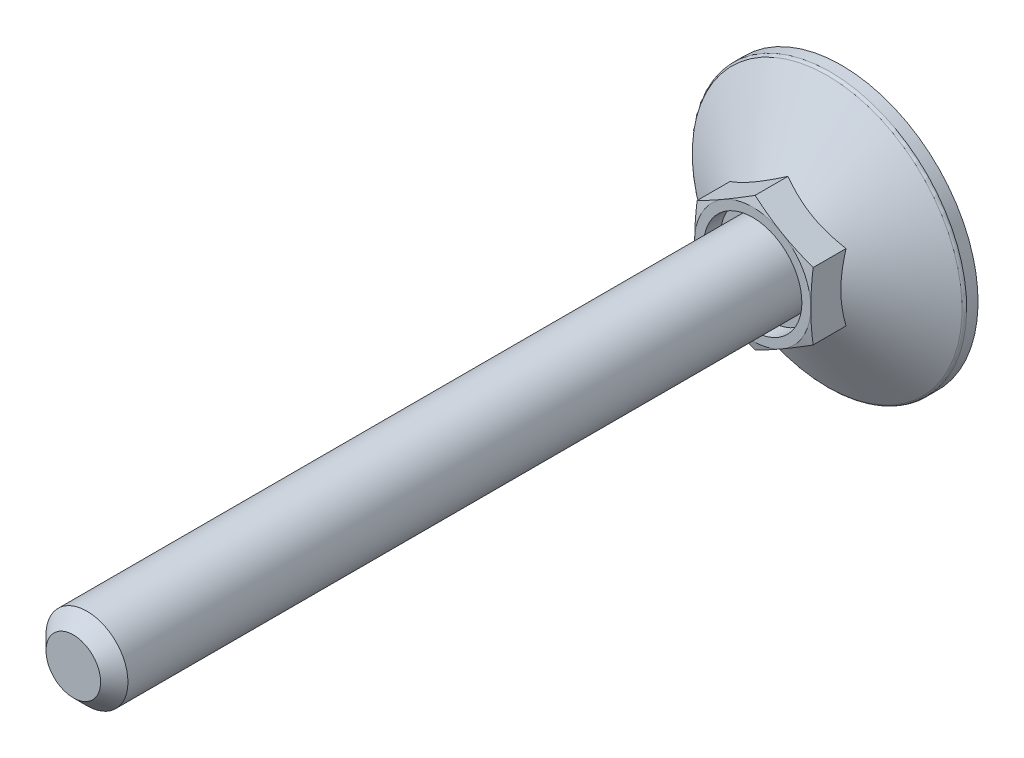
ISO-10303-21;
HEADER;
FILE_DESCRIPTION(('STEP AP214'),'2;1');
FILE_NAME('part.step','',(''),(''),'','','');
FILE_SCHEMA(('AUTOMOTIVE_DESIGN { 1 0 10303 214 1 1 1 1 }'));
ENDSEC;
DATA;
#1=APPLICATION_CONTEXT('core data for automotive mechanical design processes');
#2=APPLICATION_PROTOCOL_DEFINITION('international standard','automotive_design',2000,#1);
#3=PRODUCT_CONTEXT('',#1,'mechanical');
#4=PRODUCT('Part','Part','',(#3));
#5=PRODUCT_RELATED_PRODUCT_CATEGORY('part','',(#4));
#6=PRODUCT_DEFINITION_FORMATION('','',#4);
#7=PRODUCT_DEFINITION_CONTEXT('part definition',#1,'design');
#8=PRODUCT_DEFINITION('design','',#6,#7);
#9=PRODUCT_DEFINITION_SHAPE('','',#8);
#10=(LENGTH_UNIT() NAMED_UNIT(*) SI_UNIT(.MILLI.,.METRE.));
#11=(NAMED_UNIT(*) PLANE_ANGLE_UNIT() SI_UNIT($,.RADIAN.));
#12=(NAMED_UNIT(*) SI_UNIT($,.STERADIAN.) SOLID_ANGLE_UNIT());
#13=UNCERTAINTY_MEASURE_WITH_UNIT(LENGTH_MEASURE(1.E-05),#10,'distance_accuracy_value','');
#14=(GEOMETRIC_REPRESENTATION_CONTEXT(3) GLOBAL_UNCERTAINTY_ASSIGNED_CONTEXT((#13)) GLOBAL_UNIT_ASSIGNED_CONTEXT((#10,
#11,#12)) REPRESENTATION_CONTEXT('',''));
#15=CARTESIAN_POINT('',(0.,0.,0.));
#16=DIRECTION('',(0.,0.,1.));
#17=DIRECTION('',(1.,0.,0.));
#18=AXIS2_PLACEMENT_3D('',#15,#16,#17);
#19=CARTESIAN_POINT('',(0.,0.,10.525));
#20=DIRECTION('',(0.,0.,-1.));
#21=DIRECTION('',(0.,1.,0.));
#22=AXIS2_PLACEMENT_3D('',#19,#20,#21);
#23=PLANE('',#22);
#24=CARTESIAN_POINT('',(0.,0.,10.525));
#25=DIRECTION('',(0.,0.,-1.));
#26=DIRECTION('',(0.,1.,0.));
#27=AXIS2_PLACEMENT_3D('',#24,#25,#26);
#28=CIRCLE('',#27,7.2);
#29=CARTESIAN_POINT('',(0.,7.2,10.525));
#30=VERTEX_POINT('',#29);
#31=EDGE_CURVE('E108',#30,#30,#28,.T.);
#32=ORIENTED_EDGE('',*,*,#31,.F.);
#33=EDGE_LOOP('',(#32));
#34=FACE_BOUND('',#33,.T.);
#35=CARTESIAN_POINT('',(0.,0.,10.525));
#36=DIRECTION('',(0.,0.,-1.));
#37=DIRECTION('',(0.,1.,0.));
#38=AXIS2_PLACEMENT_3D('',#35,#36,#37);
#39=CIRCLE('',#38,6.);
#40=CARTESIAN_POINT('',(0.,6.,10.525));
#41=VERTEX_POINT('',#40);
#42=EDGE_CURVE('E260',#41,#41,#39,.F.);
#43=ORIENTED_EDGE('',*,*,#42,.F.);
#44=EDGE_LOOP('',(#43));
#45=FACE_BOUND('',#44,.T.);
#46=ADVANCED_FACE('F14',(#34,#45),#23,.F.);
#47=CARTESIAN_POINT('',(0.,9.81495457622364,99.));
#48=DIRECTION('',(0.5,-0.866025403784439,0.));
#49=DIRECTION('',(0.866025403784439,0.5,0.));
#50=AXIS2_PLACEMENT_3D('',#47,#48,#49);
#51=PLANE('',#50);
#52=CARTESIAN_POINT('',(-8.5002,4.90736181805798,7.83027204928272));
#53=CARTESIAN_POINT('',(-8.31336077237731,5.01523349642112,7.89254195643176));
#54=CARTESIAN_POINT('',(-8.1258249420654,5.1235073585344,7.95198579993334));
#55=CARTESIAN_POINT('',(-7.74923024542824,5.34093440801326,8.06444298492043));
#56=CARTESIAN_POINT('',(-7.56017075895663,5.45008795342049,8.1174535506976));
#57=CARTESIAN_POINT('',(-6.9899652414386,5.77929626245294,8.26579470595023));
#58=CARTESIAN_POINT('',(-6.60656835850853,6.00065055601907,8.3501691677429));
#59=CARTESIAN_POINT('',(-6.03282233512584,6.33190297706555,8.44910807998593));
#60=CARTESIAN_POINT('',(-5.84418723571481,6.44081150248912,8.47729289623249));
#61=CARTESIAN_POINT('',(-5.46606397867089,6.65912106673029,8.52455401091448));
#62=CARTESIAN_POINT('',(-5.27657589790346,6.76852206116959,8.54363111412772));
#63=CARTESIAN_POINT('',(-4.8972734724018,6.98751241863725,8.57219332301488));
#64=CARTESIAN_POINT('',(-4.7074597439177,7.09710142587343,8.58168931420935));
#65=CARTESIAN_POINT('',(-4.32765694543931,7.3163806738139,8.59088571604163));
#66=CARTESIAN_POINT('',(-4.13766788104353,7.42607091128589,8.59058642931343));
#67=CARTESIAN_POINT('',(-3.78247698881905,7.63114046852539,8.58087362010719));
#68=CARTESIAN_POINT('',(-3.6172500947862,7.72653426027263,8.57264492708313));
#69=CARTESIAN_POINT('',(-3.28718328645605,7.9170984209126,8.54893885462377));
#70=CARTESIAN_POINT('',(-3.12234339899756,8.01226877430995,8.53346098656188));
#71=CARTESIAN_POINT('',(-2.62846189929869,8.29741139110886,8.47651947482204));
#72=CARTESIAN_POINT('',(-2.30029449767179,8.48687892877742,8.42455503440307));
#73=CARTESIAN_POINT('',(-1.64047857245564,8.86782383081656,8.29464315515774));
#74=CARTESIAN_POINT('',(-1.30891425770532,9.05925257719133,8.21614502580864));
#75=CARTESIAN_POINT('',(-0.650730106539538,9.43925537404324,8.03798675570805));
#76=CARTESIAN_POINT('',(-0.324101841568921,9.62783429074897,7.93836845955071));
#77=CARTESIAN_POINT('',(0.000199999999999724,9.81507004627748,7.83027204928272));
#78=B_SPLINE_CURVE_WITH_KNOTS('',3,(#52,#53,#54,#55,#56,#57,#58,#59,#60,#61,#62,#63,#64,#65,#66,
#67,#68,#69,#70,#71,#72,#73,#74,#75,#76,#77),.UNSPECIFIED.,.F.,.F.,(4,2,2,2,2,2,2,2,2,2,2,2,4),
(0.,0.673596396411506,1.34748239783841,2.69805431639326,3.356799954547,4.01548737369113,
4.67342558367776,5.33134346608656,5.90409556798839,6.47688628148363,7.62328361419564,
8.79510569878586,9.9646274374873),.UNSPECIFIED.);
#79=CARTESIAN_POINT('',(-8.5,4.90747728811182,7.83033871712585));
#80=VERTEX_POINT('',#79);
#81=CARTESIAN_POINT('',(0.,9.81495457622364,7.83033871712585));
#82=VERTEX_POINT('',#81);
#83=EDGE_CURVE('E97',#80,#82,#78,.T.);
#84=ORIENTED_EDGE('',*,*,#83,.F.);
#85=DIRECTION('',(0.,0.,-1.));
#86=VECTOR('',#85,1.);
#87=CARTESIAN_POINT('',(-8.5,4.90747728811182,99.));
#88=LINE('',#87,#86);
#89=CARTESIAN_POINT('',(-8.5,4.90747728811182,12.6476589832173));
#90=VERTEX_POINT('',#89);
#91=EDGE_CURVE('E86',#90,#80,#88,.T.);
#92=ORIENTED_EDGE('',*,*,#91,.F.);
#93=CARTESIAN_POINT('',(0.000200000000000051,9.81507004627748,12.6476280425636));
#94=CARTESIAN_POINT('',(-0.352800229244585,9.61126526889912,12.7022599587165));
#95=CARTESIAN_POINT('',(-0.706440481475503,9.40709097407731,12.7518566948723));
#96=CARTESIAN_POINT('',(-1.41496987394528,8.99802133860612,12.8389934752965));
#97=CARTESIAN_POINT('',(-1.76985946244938,8.79312573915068,12.8765286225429));
#98=CARTESIAN_POINT('',(-2.47873586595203,8.38385575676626,12.9373509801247));
#99=CARTESIAN_POINT('',(-2.83271788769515,8.17948414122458,12.9607107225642));
#100=CARTESIAN_POINT('',(-3.5411333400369,7.77048028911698,12.9920337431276));
#101=CARTESIAN_POINT('',(-3.89556667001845,7.56584811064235,13.));
#102=CARTESIAN_POINT('',(-4.60443332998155,7.15658375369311,13.));
#103=CARTESIAN_POINT('',(-4.9588666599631,6.95195157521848,12.9920337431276));
#104=CARTESIAN_POINT('',(-5.66728211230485,6.54294772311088,12.9607107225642));
#105=CARTESIAN_POINT('',(-6.02126413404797,6.33857610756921,12.9373509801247));
#106=CARTESIAN_POINT('',(-6.73014053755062,5.92930612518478,12.8765286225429));
#107=CARTESIAN_POINT('',(-7.08503012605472,5.72441052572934,12.8389934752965));
#108=CARTESIAN_POINT('',(-7.7935595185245,5.31534089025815,12.7518566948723));
#109=CARTESIAN_POINT('',(-8.14719977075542,5.11116659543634,12.7022599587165));
#110=CARTESIAN_POINT('',(-8.5002,4.90736181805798,12.6476280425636));
#111=B_SPLINE_CURVE_WITH_KNOTS('',3,(#93,#94,#95,#96,#97,#98,#99,#100,#101,#102,#103,#104,#105,
#106,#107,#108,#109,#110),.UNSPECIFIED.,.F.,.F.,(4,2,2,2,2,2,2,2,4),(0.,1.23382789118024,
2.46815608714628,3.69611406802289,4.92383440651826,6.15155474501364,7.37951272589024,
8.61384092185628,9.84766881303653),.UNSPECIFIED.);
#112=CARTESIAN_POINT('',(-4.25,7.36121593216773,13.));
#113=VERTEX_POINT('',#112);
#114=EDGE_CURVE('E187',#113,#90,#111,.T.);
#115=ORIENTED_EDGE('',*,*,#114,.F.);
#116=CARTESIAN_POINT('',(0.,9.81495457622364,12.6476589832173));
#117=VERTEX_POINT('',#116);
#118=EDGE_CURVE('E319',#117,#113,#111,.T.);
#119=ORIENTED_EDGE('',*,*,#118,.F.);
#120=DIRECTION('',(0.,0.,-1.));
#121=VECTOR('',#120,1.);
#122=CARTESIAN_POINT('',(0.,9.81495457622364,99.));
#123=LINE('',#122,#121);
#124=EDGE_CURVE('E101',#117,#82,#123,.T.);
#125=ORIENTED_EDGE('',*,*,#124,.T.);
#126=EDGE_LOOP('',(#84,#92,#115,#119,#125));
#127=FACE_BOUND('',#126,.T.);
#128=ADVANCED_FACE('F100',(#127),#51,.F.);
#129=CARTESIAN_POINT('',(8.5,4.90747728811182,99.));
#130=DIRECTION('',(-0.5,-0.866025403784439,0.));
#131=DIRECTION('',(0.866025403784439,-0.5,0.));
#132=AXIS2_PLACEMENT_3D('',#129,#130,#131);
#133=PLANE('',#132);
#134=CARTESIAN_POINT('',(-0.0002,9.81507004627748,7.83027204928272));
#135=CARTESIAN_POINT('',(0.186639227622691,9.70719836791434,7.89254195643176));
#136=CARTESIAN_POINT('',(0.374175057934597,9.59892450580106,7.95198579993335));
#137=CARTESIAN_POINT('',(0.750769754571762,9.3814974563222,8.06444298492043));
#138=CARTESIAN_POINT('',(0.939829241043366,9.27234391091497,8.1174535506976));
#139=CARTESIAN_POINT('',(1.5100347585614,8.94313560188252,8.26579470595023));
#140=CARTESIAN_POINT('',(1.89343164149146,8.72178130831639,8.3501691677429));
#141=CARTESIAN_POINT('',(2.46717766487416,8.39052888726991,8.44910807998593));
#142=CARTESIAN_POINT('',(2.65581276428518,8.28162036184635,8.47729289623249));
#143=CARTESIAN_POINT('',(3.03393602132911,8.06331079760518,8.52455401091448));
#144=CARTESIAN_POINT('',(3.22342410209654,7.95390980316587,8.54363111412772));
#145=CARTESIAN_POINT('',(3.6027265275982,7.73491944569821,8.57219332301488));
#146=CARTESIAN_POINT('',(3.79254025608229,7.62533043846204,8.58168931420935));
#147=CARTESIAN_POINT('',(4.17234305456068,7.40605119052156,8.59088571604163));
#148=CARTESIAN_POINT('',(4.36233211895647,7.29636095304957,8.59058642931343));
#149=CARTESIAN_POINT('',(4.71752301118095,7.09129139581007,8.58087362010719));
#150=CARTESIAN_POINT('',(4.8827499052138,6.99589760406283,8.57264492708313));
#151=CARTESIAN_POINT('',(5.21281671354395,6.80533344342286,8.54893885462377));
#152=CARTESIAN_POINT('',(5.37765660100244,6.71016309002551,8.53346098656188));
#153=CARTESIAN_POINT('',(5.87153810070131,6.42502047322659,8.47651947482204));
#154=CARTESIAN_POINT('',(6.19970550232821,6.23555293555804,8.42455503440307));
#155=CARTESIAN_POINT('',(6.85952142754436,5.8546080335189,8.29464315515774));
#156=CARTESIAN_POINT('',(7.19108574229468,5.66317928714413,8.21614502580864));
#157=CARTESIAN_POINT('',(7.84926989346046,5.28317649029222,8.03798675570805));
#158=CARTESIAN_POINT('',(8.17589815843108,5.09459757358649,7.93836845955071));
#159=CARTESIAN_POINT('',(8.5002,4.90736181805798,7.83027204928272));
#160=B_SPLINE_CURVE_WITH_KNOTS('',3,(#134,#135,#136,#137,#138,#139,#140,#141,#142,#143,#144,
#145,#146,#147,#148,#149,#150,#151,#152,#153,#154,#155,#156,#157,#158,#159),.UNSPECIFIED.,.F.,
.F.,(4,2,2,2,2,2,2,2,2,2,2,2,4),(0.,0.673596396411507,1.34748239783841,2.69805431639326,
3.35679995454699,4.01548737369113,4.67342558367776,5.33134346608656,5.90409556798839,
6.47688628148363,7.62328361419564,8.79510569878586,9.9646274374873),.UNSPECIFIED.);
#161=CARTESIAN_POINT('',(8.5,4.90747728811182,7.83033871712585));
#162=VERTEX_POINT('',#161);
#163=EDGE_CURVE('E29',#82,#162,#160,.T.);
#164=ORIENTED_EDGE('',*,*,#163,.F.);
#165=ORIENTED_EDGE('',*,*,#124,.F.);
#166=CARTESIAN_POINT('',(8.5002,4.90736181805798,12.6476280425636));
#167=CARTESIAN_POINT('',(8.14719977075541,5.11116659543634,12.7022599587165));
#168=CARTESIAN_POINT('',(7.7935595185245,5.31534089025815,12.7518566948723));
#169=CARTESIAN_POINT('',(7.08503012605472,5.72441052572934,12.8389934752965));
#170=CARTESIAN_POINT('',(6.73014053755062,5.92930612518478,12.8765286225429));
#171=CARTESIAN_POINT('',(6.02126413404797,6.33857610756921,12.9373509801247));
#172=CARTESIAN_POINT('',(5.66728211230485,6.54294772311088,12.9607107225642));
#173=CARTESIAN_POINT('',(4.9588666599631,6.95195157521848,12.9920337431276));
#174=CARTESIAN_POINT('',(4.60443332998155,7.15658375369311,13.));
#175=CARTESIAN_POINT('',(3.89556667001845,7.56584811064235,13.));
#176=CARTESIAN_POINT('',(3.5411333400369,7.77048028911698,12.9920337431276));
#177=CARTESIAN_POINT('',(2.83271788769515,8.17948414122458,12.9607107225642));
#178=CARTESIAN_POINT('',(2.47873586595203,8.38385575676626,12.9373509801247));
#179=CARTESIAN_POINT('',(1.76985946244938,8.79312573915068,12.8765286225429));
#180=CARTESIAN_POINT('',(1.41496987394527,8.99802133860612,12.8389934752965));
#181=CARTESIAN_POINT('',(0.7064404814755,9.40709097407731,12.7518566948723));
#182=CARTESIAN_POINT('',(0.352800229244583,9.61126526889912,12.7022599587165));
#183=CARTESIAN_POINT('',(-0.000200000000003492,9.81507004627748,12.6476280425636));
#184=B_SPLINE_CURVE_WITH_KNOTS('',3,(#166,#167,#168,#169,#170,#171,#172,#173,#174,#175,#176,
#177,#178,#179,#180,#181,#182,#183),.UNSPECIFIED.,.F.,.F.,(4,2,2,2,2,2,2,2,4),(0.,
1.23382789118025,2.46815608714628,3.69611406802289,4.92383440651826,6.15155474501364,
7.37951272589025,8.61384092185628,9.84766881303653),.UNSPECIFIED.);
#185=CARTESIAN_POINT('',(4.25,7.36121593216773,13.));
#186=VERTEX_POINT('',#185);
#187=EDGE_CURVE('E178',#186,#117,#184,.T.);
#188=ORIENTED_EDGE('',*,*,#187,.F.);
#189=CARTESIAN_POINT('',(8.5,4.90747728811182,12.6476589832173));
#190=VERTEX_POINT('',#189);
#191=EDGE_CURVE('E185',#190,#186,#184,.T.);
#192=ORIENTED_EDGE('',*,*,#191,.F.);
#193=DIRECTION('',(0.,0.,-1.));
#194=VECTOR('',#193,1.);
#195=CARTESIAN_POINT('',(8.5,4.90747728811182,99.));
#196=LINE('',#195,#194);
#197=EDGE_CURVE('E217',#190,#162,#196,.T.);
#198=ORIENTED_EDGE('',*,*,#197,.T.);
#199=EDGE_LOOP('',(#164,#165,#188,#192,#198));
#200=FACE_BOUND('',#199,.T.);
#201=ADVANCED_FACE('F193',(#200),#133,.F.);
#202=CARTESIAN_POINT('',(8.5,-4.90747728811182,99.));
#203=DIRECTION('',(-1.,0.,0.));
#204=DIRECTION('',(0.,-1.,0.));
#205=AXIS2_PLACEMENT_3D('',#202,#203,#204);
#206=PLANE('',#205);
#207=CARTESIAN_POINT('',(8.5,12.8220542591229,4.61528116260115));
#208=CARTESIAN_POINT('',(8.5,12.4534155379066,4.79262377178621));
#209=CARTESIAN_POINT('',(8.5,12.0838902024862,4.96815716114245));
#210=CARTESIAN_POINT('',(8.5,11.3425927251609,5.31457894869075));
#211=CARTESIAN_POINT('',(8.5,10.9708202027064,5.48546653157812));
#212=CARTESIAN_POINT('',(8.5,10.2224625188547,5.82250763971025));
#213=CARTESIAN_POINT('',(8.5,9.84586188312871,5.98862693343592));
#214=CARTESIAN_POINT('',(8.5,9.08953299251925,6.31355867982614));
#215=CARTESIAN_POINT('',(8.5,8.70980489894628,6.47237150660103));
#216=CARTESIAN_POINT('',(8.5,7.93635853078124,6.78489169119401));
#217=CARTESIAN_POINT('',(8.5,7.5425381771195,6.93834789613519));
#218=CARTESIAN_POINT('',(8.5,6.75016193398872,7.23275009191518));
#219=CARTESIAN_POINT('',(8.5,6.35160550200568,7.37369463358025));
#220=CARTESIAN_POINT('',(8.5,5.54998630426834,7.63911020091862));
#221=CARTESIAN_POINT('',(8.5,5.14693580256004,7.76361784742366));
#222=CARTESIAN_POINT('',(8.5,4.33508769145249,7.99193558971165));
#223=CARTESIAN_POINT('',(8.5,3.92629204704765,8.09575258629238));
#224=CARTESIAN_POINT('',(8.5,3.10458766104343,8.27700176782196));
#225=CARTESIAN_POINT('',(8.5,2.69170444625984,8.35454642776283));
#226=CARTESIAN_POINT('',(8.5,2.06892742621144,8.44757828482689));
#227=CARTESIAN_POINT('',(8.5,1.86074253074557,8.47470931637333));
#228=CARTESIAN_POINT('',(8.5,1.44346514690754,8.52067173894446));
#229=CARTESIAN_POINT('',(8.5,1.23437274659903,8.5395039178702));
#230=CARTESIAN_POINT('',(8.5,0.818123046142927,8.5682751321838));
#231=CARTESIAN_POINT('',(8.5,0.6109730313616,8.57831925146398));
#232=CARTESIAN_POINT('',(8.5,0.196434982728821,8.58967320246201));
#233=CARTESIAN_POINT('',(8.5,-0.0109530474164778,8.59098316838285));
#234=CARTESIAN_POINT('',(8.5,-0.425608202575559,8.58483724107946));
#235=CARTESIAN_POINT('',(8.5,-0.632875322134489,8.57738097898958));
#236=CARTESIAN_POINT('',(8.5,-1.04692490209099,8.55387613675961));
#237=CARTESIAN_POINT('',(8.5,-1.25370733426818,8.5378270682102));
#238=CARTESIAN_POINT('',(8.5,-1.76172684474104,8.48816674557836));
#239=CARTESIAN_POINT('',(8.5,-2.06251418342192,8.44986872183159));
#240=CARTESIAN_POINT('',(8.5,-2.66160170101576,8.35726697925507));
#241=CARTESIAN_POINT('',(8.5,-2.95990148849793,8.30296078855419));
#242=CARTESIAN_POINT('',(8.5,-3.85084347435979,8.11893322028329));
#243=CARTESIAN_POINT('',(8.5,-4.4391769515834,7.96814146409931));
#244=CARTESIAN_POINT('',(8.5,-5.31919968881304,7.70971639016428));
#245=CARTESIAN_POINT('',(8.5,-5.61551051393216,7.61694416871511));
#246=CARTESIAN_POINT('',(8.5,-6.20524874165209,7.4225646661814));
#247=CARTESIAN_POINT('',(8.5,-6.4986761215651,7.3209573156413));
#248=CARTESIAN_POINT('',(8.5,-7.08276471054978,7.11046965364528));
#249=CARTESIAN_POINT('',(8.5,-7.37342689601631,7.0015920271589));
#250=CARTESIAN_POINT('',(8.5,-7.95239195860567,6.77777126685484));
#251=CARTESIAN_POINT('',(8.5,-8.2406948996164,6.66282829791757));
#252=CARTESIAN_POINT('',(8.5,-8.80562449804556,6.43181846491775));
#253=CARTESIAN_POINT('',(8.5,-9.08231928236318,6.31591764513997));
#254=CARTESIAN_POINT('',(8.5,-9.63401072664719,6.0801365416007));
#255=CARTESIAN_POINT('',(8.5,-9.90900735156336,5.96025617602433));
#256=CARTESIAN_POINT('',(8.5,-10.7318217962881,5.59557173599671));
#257=CARTESIAN_POINT('',(8.5,-11.2774137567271,5.34574521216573));
#258=CARTESIAN_POINT('',(8.5,-12.3642460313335,4.83628492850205));
#259=CARTESIAN_POINT('',(8.5,-12.905484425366,4.57664710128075));
#260=CARTESIAN_POINT('',(8.5,-13.9843891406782,4.05013469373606));
#261=CARTESIAN_POINT('',(8.5,-14.5220556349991,3.78326046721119));
#262=CARTESIAN_POINT('',(8.5,-15.5954930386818,3.24355438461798));
#263=CARTESIAN_POINT('',(8.5,-16.1312593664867,2.97071343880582));
#264=CARTESIAN_POINT('',(8.5,-17.2005865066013,2.4207361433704));
#265=CARTESIAN_POINT('',(8.5,-17.7341472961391,2.14359974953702));
#266=CARTESIAN_POINT('',(8.5,-18.7993643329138,1.58600707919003));
#267=CARTESIAN_POINT('',(8.5,-19.3310210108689,1.30555162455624));
#268=CARTESIAN_POINT('',(8.5,-20.3928917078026,0.741921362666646));
#269=CARTESIAN_POINT('',(8.5,-20.9231057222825,0.458746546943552));
#270=CARTESIAN_POINT('',(8.5,-22.3874236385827,-0.32722037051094));
#271=CARTESIAN_POINT('',(8.5,-23.3202800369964,-0.83233607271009));
#272=CARTESIAN_POINT('',(8.5,-25.1833983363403,-1.84747335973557));
#273=CARTESIAN_POINT('',(8.5,-26.1136600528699,-2.35749528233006));
#274=CARTESIAN_POINT('',(8.5,-27.9692131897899,-3.37950461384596));
#275=CARTESIAN_POINT('',(8.5,-28.8945109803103,-3.89148046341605));
#276=CARTESIAN_POINT('',(8.5,-30.2812847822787,-4.66146611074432));
#277=CARTESIAN_POINT('',(8.5,-30.7433285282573,-4.91845451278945));
#278=CARTESIAN_POINT('',(8.5,-31.6670795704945,-5.43303439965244));
#279=CARTESIAN_POINT('',(8.5,-32.1287868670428,-5.69062588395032));
#280=CARTESIAN_POINT('',(8.5,-32.5903473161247,-5.94848028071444));
#281=B_SPLINE_CURVE_WITH_KNOTS('',3,(#207,#208,#209,#210,#211,#212,#213,#214,#215,#216,#217,
#218,#219,#220,#221,#222,#223,#224,#225,#226,#227,#228,#229,#230,#231,#232,#233,#234,#235,#236,
#237,#238,#239,#240,#241,#242,#243,#244,#245,#246,#247,#248,#249,#250,#251,#252,#253,#254,#255,
#256,#257,#258,#259,#260,#261,#262,#263,#264,#265,#266,#267,#268,#269,#270,#271,#272,#273,#274,
#275,#276,#277,#278,#279,#280),.UNSPECIFIED.,.F.,.F.,(4,2,2,2,2,2,2,2,2,2,2,2,2,2,2,2,2,2,2,2,2,
2,2,2,2,2,2,2,2,2,2,2,2,2,2,2,4),(0.,1.22725127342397,2.45471654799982,3.68948778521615,
4.92419572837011,6.19201746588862,7.45998585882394,8.72507978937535,9.98975107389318,
11.2489376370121,11.878634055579,12.5082706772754,13.1302712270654,13.7522622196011,
14.3742793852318,14.9963319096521,15.9054589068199,16.814726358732,18.6343169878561,
19.5657329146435,20.4971561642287,21.4282373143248,22.3592931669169,23.259222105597,
24.1591695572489,25.9592281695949,27.7600413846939,29.5607667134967,31.3644583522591,
33.1681685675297,34.9714411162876,36.7747192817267,39.9571898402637,43.1398810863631,
46.3123590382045,47.8984694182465,49.4845784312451),.UNSPECIFIED.);
#282=CARTESIAN_POINT('',(8.5,-4.90747728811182,7.83033871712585));
#283=VERTEX_POINT('',#282);
#284=EDGE_CURVE('E37',#162,#283,#281,.T.);
#285=ORIENTED_EDGE('',*,*,#284,.F.);
#286=ORIENTED_EDGE('',*,*,#197,.F.);
#287=CARTESIAN_POINT('',(8.5,12.9820891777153,11.1197370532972));
#288=CARTESIAN_POINT('',(8.5,12.5964686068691,11.2061594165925));
#289=CARTESIAN_POINT('',(8.5,12.2106068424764,11.2915248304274));
#290=CARTESIAN_POINT('',(8.5,11.4382824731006,11.4595712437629));
#291=CARTESIAN_POINT('',(8.5,11.0518198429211,11.5422521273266));
#292=CARTESIAN_POINT('',(8.5,10.2778290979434,11.7044309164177));
#293=CARTESIAN_POINT('',(8.5,9.89030030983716,11.7839256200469));
#294=CARTESIAN_POINT('',(8.5,9.11443612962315,11.9388739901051));
#295=CARTESIAN_POINT('',(8.5,8.72610074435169,12.0143276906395));
#296=CARTESIAN_POINT('',(8.5,7.95158013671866,12.159650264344));
#297=CARTESIAN_POINT('',(8.5,7.56540239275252,12.2295587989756));
#298=CARTESIAN_POINT('',(8.5,6.79199352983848,12.3632725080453));
#299=CARTESIAN_POINT('',(8.5,6.40476243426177,12.4270778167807));
#300=CARTESIAN_POINT('',(8.5,5.62917169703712,12.54714843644));
#301=CARTESIAN_POINT('',(8.5,5.24081220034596,12.6034146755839));
#302=CARTESIAN_POINT('',(8.5,4.46285737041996,12.70674908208));
#303=CARTESIAN_POINT('',(8.5,4.07326203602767,12.7538172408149));
#304=CARTESIAN_POINT('',(8.5,3.28844017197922,12.8374226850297));
#305=CARTESIAN_POINT('',(8.5,2.89320002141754,12.8738340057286));
#306=CARTESIAN_POINT('',(8.5,2.10172608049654,12.9336139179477));
#307=CARTESIAN_POINT('',(8.5,1.70549231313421,12.9569828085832));
#308=CARTESIAN_POINT('',(8.5,0.912605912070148,12.9893148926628));
#309=CARTESIAN_POINT('',(8.5,0.515953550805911,12.9982846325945));
#310=CARTESIAN_POINT('',(8.5,-0.27740821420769,13.0012669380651));
#311=CARTESIAN_POINT('',(8.5,-0.674117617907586,12.9952795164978));
#312=CARTESIAN_POINT('',(8.5,-1.46847963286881,12.9686842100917));
#313=CARTESIAN_POINT('',(8.5,-1.86613043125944,12.9480232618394));
#314=CARTESIAN_POINT('',(8.5,-2.66049684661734,12.8932602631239));
#315=CARTESIAN_POINT('',(8.5,-3.05721244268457,12.8591579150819));
#316=CARTESIAN_POINT('',(8.5,-3.84970511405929,12.7792347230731));
#317=CARTESIAN_POINT('',(8.5,-4.24548140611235,12.7334062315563));
#318=CARTESIAN_POINT('',(8.5,-5.03576028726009,12.6319377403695));
#319=CARTESIAN_POINT('',(8.5,-5.43026287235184,12.5762977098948));
#320=CARTESIAN_POINT('',(8.5,-6.19195385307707,12.4609360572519));
#321=CARTESIAN_POINT('',(8.5,-6.55922094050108,12.4017287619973));
#322=CARTESIAN_POINT('',(8.5,-7.29278719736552,12.2775674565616));
#323=CARTESIAN_POINT('',(8.5,-7.65908634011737,12.2126132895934));
#324=CARTESIAN_POINT('',(8.5,-8.39085027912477,12.078008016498));
#325=CARTESIAN_POINT('',(8.5,-8.75631499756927,12.0083564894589));
#326=CARTESIAN_POINT('',(8.5,-9.48649515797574,11.8652200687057));
#327=CARTESIAN_POINT('',(8.5,-9.85121059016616,11.7917351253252));
#328=CARTESIAN_POINT('',(8.5,-10.5800753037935,11.6416087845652));
#329=CARTESIAN_POINT('',(8.5,-10.944224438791,11.5649666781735));
#330=CARTESIAN_POINT('',(8.5,-11.6719684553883,11.4090909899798));
#331=CARTESIAN_POINT('',(8.5,-12.0355633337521,11.3298573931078));
#332=CARTESIAN_POINT('',(8.5,-13.1255915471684,11.0889686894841));
#333=CARTESIAN_POINT('',(8.5,-13.8513178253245,10.9241153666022));
#334=CARTESIAN_POINT('',(8.5,-15.2942598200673,10.590109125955));
#335=CARTESIAN_POINT('',(8.5,-16.0114890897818,10.421014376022));
#336=CARTESIAN_POINT('',(8.5,-17.4449475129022,10.0785875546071));
#337=CARTESIAN_POINT('',(8.5,-18.1611766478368,9.9052554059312));
#338=CARTESIAN_POINT('',(8.5,-19.5919856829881,9.55567998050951));
#339=CARTESIAN_POINT('',(8.5,-20.306566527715,9.37944056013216));
#340=CARTESIAN_POINT('',(8.5,-21.7351057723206,9.02455520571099));
#341=CARTESIAN_POINT('',(8.5,-22.4490641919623,8.84590935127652));
#342=CARTESIAN_POINT('',(8.5,-23.1628057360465,8.66641079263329));
#343=B_SPLINE_CURVE_WITH_KNOTS('',3,(#287,#288,#289,#290,#291,#292,#293,#294,#295,#296,#297,
#298,#299,#300,#301,#302,#303,#304,#305,#306,#307,#308,#309,#310,#311,#312,#313,#314,#315,#316,
#317,#318,#319,#320,#321,#322,#323,#324,#325,#326,#327,#328,#329,#330,#331,#332,#333,#334,#335,
#336,#337,#338,#339,#340,#341,#342),.UNSPECIFIED.,.F.,.F.,(4,2,2,2,2,2,2,2,2,2,2,2,2,2,2,2,2,2,
2,2,2,2,2,2,2,2,2,4),(0.,1.18556310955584,2.37117735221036,3.5579546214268,4.74472187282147,
5.92204594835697,7.09934411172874,8.27649719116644,9.45365137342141,10.6442044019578,
11.8347301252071,13.0247144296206,14.2146977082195,15.4090063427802,16.6033414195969,
17.7984574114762,18.9935771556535,20.1095500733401,21.2255534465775,22.3416569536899,
23.4577749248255,24.5741449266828,25.6905214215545,27.9231231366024,30.1337863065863,
32.3444897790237,34.5524651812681,36.7603677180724),.UNSPECIFIED.);
#344=CARTESIAN_POINT('',(8.5,0.,13.));
#345=VERTEX_POINT('',#344);
#346=EDGE_CURVE('E171',#345,#190,#343,.F.);
#347=ORIENTED_EDGE('',*,*,#346,.F.);
#348=CARTESIAN_POINT('',(8.5,-4.90747728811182,12.6476589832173));
#349=VERTEX_POINT('',#348);
#350=EDGE_CURVE('E186',#349,#345,#343,.F.);
#351=ORIENTED_EDGE('',*,*,#350,.F.);
#352=DIRECTION('',(0.,0.,-1.));
#353=VECTOR('',#352,1.);
#354=CARTESIAN_POINT('',(8.5,-4.90747728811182,99.));
#355=LINE('',#354,#353);
#356=EDGE_CURVE('E219',#349,#283,#355,.T.);
#357=ORIENTED_EDGE('',*,*,#356,.T.);
#358=EDGE_LOOP('',(#285,#286,#347,#351,#357));
#359=FACE_BOUND('',#358,.T.);
#360=ADVANCED_FACE('F196',(#359),#206,.F.);
#361=CARTESIAN_POINT('',(0.,-9.81495457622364,99.));
#362=DIRECTION('',(-0.5,0.866025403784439,0.));
#363=DIRECTION('',(-0.866025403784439,-0.5,0.));
#364=AXIS2_PLACEMENT_3D('',#361,#362,#363);
#365=PLANE('',#364);
#366=CARTESIAN_POINT('',(8.5002,-4.90736181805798,7.83027204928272));
#367=CARTESIAN_POINT('',(8.31336077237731,-5.01523349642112,7.89254195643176));
#368=CARTESIAN_POINT('',(8.1258249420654,-5.1235073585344,7.95198579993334));
#369=CARTESIAN_POINT('',(7.74923024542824,-5.34093440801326,8.06444298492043));
#370=CARTESIAN_POINT('',(7.56017075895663,-5.45008795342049,8.1174535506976));
#371=CARTESIAN_POINT('',(6.9899652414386,-5.77929626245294,8.26579470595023));
#372=CARTESIAN_POINT('',(6.60656835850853,-6.00065055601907,8.3501691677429));
#373=CARTESIAN_POINT('',(6.03282233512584,-6.33190297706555,8.44910807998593));
#374=CARTESIAN_POINT('',(5.84418723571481,-6.44081150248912,8.47729289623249));
#375=CARTESIAN_POINT('',(5.46606397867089,-6.65912106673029,8.52455401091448));
#376=CARTESIAN_POINT('',(5.27657589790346,-6.76852206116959,8.54363111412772));
#377=CARTESIAN_POINT('',(4.8972734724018,-6.98751241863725,8.57219332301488));
#378=CARTESIAN_POINT('',(4.7074597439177,-7.09710142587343,8.58168931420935));
#379=CARTESIAN_POINT('',(4.32765694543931,-7.3163806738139,8.59088571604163));
#380=CARTESIAN_POINT('',(4.13766788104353,-7.42607091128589,8.59058642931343));
#381=CARTESIAN_POINT('',(3.78247698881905,-7.63114046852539,8.58087362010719));
#382=CARTESIAN_POINT('',(3.6172500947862,-7.72653426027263,8.57264492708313));
#383=CARTESIAN_POINT('',(3.28718328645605,-7.9170984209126,8.54893885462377));
#384=CARTESIAN_POINT('',(3.12234339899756,-8.01226877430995,8.53346098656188));
#385=CARTESIAN_POINT('',(2.62846189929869,-8.29741139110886,8.47651947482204));
#386=CARTESIAN_POINT('',(2.30029449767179,-8.48687892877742,8.42455503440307));
#387=CARTESIAN_POINT('',(1.64047857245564,-8.86782383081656,8.29464315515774));
#388=CARTESIAN_POINT('',(1.30891425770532,-9.05925257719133,8.21614502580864));
#389=CARTESIAN_POINT('',(0.650730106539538,-9.43925537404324,8.03798675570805));
#390=CARTESIAN_POINT('',(0.324101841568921,-9.62783429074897,7.93836845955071));
#391=CARTESIAN_POINT('',(-0.000199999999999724,-9.81507004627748,7.83027204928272));
#392=B_SPLINE_CURVE_WITH_KNOTS('',3,(#366,#367,#368,#369,#370,#371,#372,#373,#374,#375,#376,
#377,#378,#379,#380,#381,#382,#383,#384,#385,#386,#387,#388,#389,#390,#391),.UNSPECIFIED.,.F.,
.F.,(4,2,2,2,2,2,2,2,2,2,2,2,4),(0.,0.673596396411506,1.34748239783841,2.69805431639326,
3.356799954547,4.01548737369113,4.67342558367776,5.33134346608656,5.90409556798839,
6.47688628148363,7.62328361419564,8.79510569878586,9.9646274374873),.UNSPECIFIED.);
#393=CARTESIAN_POINT('',(0.,-9.81495457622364,7.83033871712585));
#394=VERTEX_POINT('',#393);
#395=EDGE_CURVE('E277',#283,#394,#392,.T.);
#396=ORIENTED_EDGE('',*,*,#395,.F.);
#397=ORIENTED_EDGE('',*,*,#356,.F.);
#398=CARTESIAN_POINT('',(-0.000200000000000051,-9.81507004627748,12.6476280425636));
#399=CARTESIAN_POINT('',(0.352800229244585,-9.61126526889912,12.7022599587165));
#400=CARTESIAN_POINT('',(0.706440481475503,-9.40709097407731,12.7518566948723));
#401=CARTESIAN_POINT('',(1.41496987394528,-8.99802133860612,12.8389934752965));
#402=CARTESIAN_POINT('',(1.76985946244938,-8.79312573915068,12.8765286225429));
#403=CARTESIAN_POINT('',(2.47873586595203,-8.38385575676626,12.9373509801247));
#404=CARTESIAN_POINT('',(2.83271788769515,-8.17948414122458,12.9607107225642));
#405=CARTESIAN_POINT('',(3.5411333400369,-7.77048028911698,12.9920337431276));
#406=CARTESIAN_POINT('',(3.89556667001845,-7.56584811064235,13.));
#407=CARTESIAN_POINT('',(4.60443332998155,-7.15658375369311,13.));
#408=CARTESIAN_POINT('',(4.9588666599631,-6.95195157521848,12.9920337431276));
#409=CARTESIAN_POINT('',(5.66728211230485,-6.54294772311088,12.9607107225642));
#410=CARTESIAN_POINT('',(6.02126413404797,-6.33857610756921,12.9373509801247));
#411=CARTESIAN_POINT('',(6.73014053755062,-5.92930612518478,12.8765286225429));
#412=CARTESIAN_POINT('',(7.08503012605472,-5.72441052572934,12.8389934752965));
#413=CARTESIAN_POINT('',(7.7935595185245,-5.31534089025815,12.7518566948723));
#414=CARTESIAN_POINT('',(8.14719977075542,-5.11116659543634,12.7022599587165));
#415=CARTESIAN_POINT('',(8.5002,-4.90736181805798,12.6476280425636));
#416=B_SPLINE_CURVE_WITH_KNOTS('',3,(#398,#399,#400,#401,#402,#403,#404,#405,#406,#407,#408,
#409,#410,#411,#412,#413,#414,#415),.UNSPECIFIED.,.F.,.F.,(4,2,2,2,2,2,2,2,4),(0.,
1.23382789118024,2.46815608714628,3.69611406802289,4.92383440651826,6.15155474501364,
7.37951272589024,8.61384092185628,9.84766881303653),.UNSPECIFIED.);
#417=CARTESIAN_POINT('',(4.25,-7.36121593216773,13.));
#418=VERTEX_POINT('',#417);
#419=EDGE_CURVE('E165',#418,#349,#416,.T.);
#420=ORIENTED_EDGE('',*,*,#419,.F.);
#421=CARTESIAN_POINT('',(0.,-9.81495457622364,12.6476589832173));
#422=VERTEX_POINT('',#421);
#423=EDGE_CURVE('E300',#422,#418,#416,.T.);
#424=ORIENTED_EDGE('',*,*,#423,.F.);
#425=DIRECTION('',(0.,0.,-1.));
#426=VECTOR('',#425,1.);
#427=CARTESIAN_POINT('',(0.,-9.81495457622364,99.));
#428=LINE('',#427,#426);
#429=EDGE_CURVE('E221',#422,#394,#428,.T.);
#430=ORIENTED_EDGE('',*,*,#429,.T.);
#431=EDGE_LOOP('',(#396,#397,#420,#424,#430));
#432=FACE_BOUND('',#431,.T.);
#433=ADVANCED_FACE('F282',(#432),#365,.F.);
#434=CARTESIAN_POINT('',(-8.5,-4.90747728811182,99.));
#435=DIRECTION('',(0.5,0.866025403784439,0.));
#436=DIRECTION('',(-0.866025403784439,0.5,0.));
#437=AXIS2_PLACEMENT_3D('',#434,#435,#436);
#438=PLANE('',#437);
#439=CARTESIAN_POINT('',(0.0002,-9.81507004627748,7.83027204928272));
#440=CARTESIAN_POINT('',(-0.186639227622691,-9.70719836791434,7.89254195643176));
#441=CARTESIAN_POINT('',(-0.374175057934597,-9.59892450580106,7.95198579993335));
#442=CARTESIAN_POINT('',(-0.750769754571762,-9.3814974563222,8.06444298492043));
#443=CARTESIAN_POINT('',(-0.939829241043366,-9.27234391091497,8.1174535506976));
#444=CARTESIAN_POINT('',(-1.5100347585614,-8.94313560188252,8.26579470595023));
#445=CARTESIAN_POINT('',(-1.89343164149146,-8.72178130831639,8.3501691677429));
#446=CARTESIAN_POINT('',(-2.46717766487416,-8.39052888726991,8.44910807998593));
#447=CARTESIAN_POINT('',(-2.65581276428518,-8.28162036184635,8.47729289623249));
#448=CARTESIAN_POINT('',(-3.03393602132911,-8.06331079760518,8.52455401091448));
#449=CARTESIAN_POINT('',(-3.22342410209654,-7.95390980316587,8.54363111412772));
#450=CARTESIAN_POINT('',(-3.6027265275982,-7.73491944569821,8.57219332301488));
#451=CARTESIAN_POINT('',(-3.79254025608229,-7.62533043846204,8.58168931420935));
#452=CARTESIAN_POINT('',(-4.17234305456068,-7.40605119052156,8.59088571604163));
#453=CARTESIAN_POINT('',(-4.36233211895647,-7.29636095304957,8.59058642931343));
#454=CARTESIAN_POINT('',(-4.71752301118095,-7.09129139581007,8.58087362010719));
#455=CARTESIAN_POINT('',(-4.8827499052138,-6.99589760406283,8.57264492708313));
#456=CARTESIAN_POINT('',(-5.21281671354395,-6.80533344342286,8.54893885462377));
#457=CARTESIAN_POINT('',(-5.37765660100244,-6.71016309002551,8.53346098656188));
#458=CARTESIAN_POINT('',(-5.87153810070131,-6.42502047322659,8.47651947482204));
#459=CARTESIAN_POINT('',(-6.19970550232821,-6.23555293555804,8.42455503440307));
#460=CARTESIAN_POINT('',(-6.85952142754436,-5.8546080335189,8.29464315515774));
#461=CARTESIAN_POINT('',(-7.19108574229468,-5.66317928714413,8.21614502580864));
#462=CARTESIAN_POINT('',(-7.84926989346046,-5.28317649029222,8.03798675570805));
#463=CARTESIAN_POINT('',(-8.17589815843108,-5.09459757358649,7.93836845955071));
#464=CARTESIAN_POINT('',(-8.5002,-4.90736181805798,7.83027204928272));
#465=B_SPLINE_CURVE_WITH_KNOTS('',3,(#439,#440,#441,#442,#443,#444,#445,#446,#447,#448,#449,
#450,#451,#452,#453,#454,#455,#456,#457,#458,#459,#460,#461,#462,#463,#464),.UNSPECIFIED.,.F.,
.F.,(4,2,2,2,2,2,2,2,2,2,2,2,4),(0.,0.673596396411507,1.34748239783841,2.69805431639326,
3.35679995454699,4.01548737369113,4.67342558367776,5.33134346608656,5.90409556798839,
6.47688628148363,7.62328361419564,8.79510569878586,9.9646274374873),.UNSPECIFIED.);
#466=CARTESIAN_POINT('',(-8.5,-4.90747728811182,7.83033871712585));
#467=VERTEX_POINT('',#466);
#468=EDGE_CURVE('E107',#394,#467,#465,.T.);
#469=ORIENTED_EDGE('',*,*,#468,.F.);
#470=ORIENTED_EDGE('',*,*,#429,.F.);
#471=CARTESIAN_POINT('',(-8.5002,-4.90736181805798,12.6476280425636));
#472=CARTESIAN_POINT('',(-8.14719977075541,-5.11116659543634,12.7022599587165));
#473=CARTESIAN_POINT('',(-7.7935595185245,-5.31534089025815,12.7518566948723));
#474=CARTESIAN_POINT('',(-7.08503012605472,-5.72441052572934,12.8389934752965));
#475=CARTESIAN_POINT('',(-6.73014053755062,-5.92930612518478,12.8765286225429));
#476=CARTESIAN_POINT('',(-6.02126413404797,-6.33857610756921,12.9373509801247));
#477=CARTESIAN_POINT('',(-5.66728211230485,-6.54294772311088,12.9607107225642));
#478=CARTESIAN_POINT('',(-4.9588666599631,-6.95195157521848,12.9920337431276));
#479=CARTESIAN_POINT('',(-4.60443332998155,-7.15658375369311,13.));
#480=CARTESIAN_POINT('',(-3.89556667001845,-7.56584811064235,13.));
#481=CARTESIAN_POINT('',(-3.5411333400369,-7.77048028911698,12.9920337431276));
#482=CARTESIAN_POINT('',(-2.83271788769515,-8.17948414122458,12.9607107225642));
#483=CARTESIAN_POINT('',(-2.47873586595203,-8.38385575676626,12.9373509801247));
#484=CARTESIAN_POINT('',(-1.76985946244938,-8.79312573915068,12.8765286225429));
#485=CARTESIAN_POINT('',(-1.41496987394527,-8.99802133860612,12.8389934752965));
#486=CARTESIAN_POINT('',(-0.7064404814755,-9.40709097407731,12.7518566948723));
#487=CARTESIAN_POINT('',(-0.352800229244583,-9.61126526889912,12.7022599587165));
#488=CARTESIAN_POINT('',(0.000200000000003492,-9.81507004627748,12.6476280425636));
#489=B_SPLINE_CURVE_WITH_KNOTS('',3,(#471,#472,#473,#474,#475,#476,#477,#478,#479,#480,#481,
#482,#483,#484,#485,#486,#487,#488),.UNSPECIFIED.,.F.,.F.,(4,2,2,2,2,2,2,2,4),(0.,
1.23382789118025,2.46815608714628,3.69611406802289,4.92383440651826,6.15155474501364,
7.37951272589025,8.61384092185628,9.84766881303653),.UNSPECIFIED.);
#490=CARTESIAN_POINT('',(-4.25,-7.36121593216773,13.));
#491=VERTEX_POINT('',#490);
#492=EDGE_CURVE('E144',#491,#422,#489,.T.);
#493=ORIENTED_EDGE('',*,*,#492,.F.);
#494=CARTESIAN_POINT('',(-8.5,-4.90747728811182,12.6476589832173));
#495=VERTEX_POINT('',#494);
#496=EDGE_CURVE('E227',#495,#491,#489,.T.);
#497=ORIENTED_EDGE('',*,*,#496,.F.);
#498=DIRECTION('',(0.,0.,-1.));
#499=VECTOR('',#498,1.);
#500=CARTESIAN_POINT('',(-8.5,-4.90747728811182,99.));
#501=LINE('',#500,#499);
#502=EDGE_CURVE('E96',#495,#467,#501,.T.);
#503=ORIENTED_EDGE('',*,*,#502,.T.);
#504=EDGE_LOOP('',(#469,#470,#493,#497,#503));
#505=FACE_BOUND('',#504,.T.);
#506=ADVANCED_FACE('F129',(#505),#438,.F.);
#507=CARTESIAN_POINT('',(-8.5,4.90747728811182,99.));
#508=DIRECTION('',(1.,0.,0.));
#509=DIRECTION('',(0.,1.,0.));
#510=AXIS2_PLACEMENT_3D('',#507,#508,#509);
#511=PLANE('',#510);
#512=CARTESIAN_POINT('',(-8.5,12.8220542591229,4.61528116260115));
#513=CARTESIAN_POINT('',(-8.5,12.4534155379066,4.79262377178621));
#514=CARTESIAN_POINT('',(-8.5,12.0838902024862,4.96815716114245));
#515=CARTESIAN_POINT('',(-8.5,11.3425927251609,5.31457894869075));
#516=CARTESIAN_POINT('',(-8.5,10.9708202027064,5.48546653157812));
#517=CARTESIAN_POINT('',(-8.5,10.2224625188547,5.82250763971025));
#518=CARTESIAN_POINT('',(-8.5,9.84586188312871,5.98862693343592));
#519=CARTESIAN_POINT('',(-8.5,9.08953299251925,6.31355867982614));
#520=CARTESIAN_POINT('',(-8.5,8.70980489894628,6.47237150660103));
#521=CARTESIAN_POINT('',(-8.5,7.93635853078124,6.78489169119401));
#522=CARTESIAN_POINT('',(-8.5,7.5425381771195,6.93834789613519));
#523=CARTESIAN_POINT('',(-8.5,6.75016193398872,7.23275009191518));
#524=CARTESIAN_POINT('',(-8.5,6.35160550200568,7.37369463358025));
#525=CARTESIAN_POINT('',(-8.5,5.54998630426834,7.63911020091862));
#526=CARTESIAN_POINT('',(-8.5,5.14693580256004,7.76361784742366));
#527=CARTESIAN_POINT('',(-8.5,4.33508769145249,7.99193558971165));
#528=CARTESIAN_POINT('',(-8.5,3.92629204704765,8.09575258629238));
#529=CARTESIAN_POINT('',(-8.5,3.10458766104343,8.27700176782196));
#530=CARTESIAN_POINT('',(-8.5,2.69170444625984,8.35454642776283));
#531=CARTESIAN_POINT('',(-8.5,2.06892742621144,8.44757828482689));
#532=CARTESIAN_POINT('',(-8.5,1.86074253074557,8.47470931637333));
#533=CARTESIAN_POINT('',(-8.5,1.44346514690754,8.52067173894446));
#534=CARTESIAN_POINT('',(-8.5,1.23437274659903,8.5395039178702));
#535=CARTESIAN_POINT('',(-8.5,0.818123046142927,8.5682751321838));
#536=CARTESIAN_POINT('',(-8.5,0.6109730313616,8.57831925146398));
#537=CARTESIAN_POINT('',(-8.5,0.196434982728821,8.58967320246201));
#538=CARTESIAN_POINT('',(-8.5,-0.0109530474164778,8.59098316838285));
#539=CARTESIAN_POINT('',(-8.5,-0.425608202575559,8.58483724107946));
#540=CARTESIAN_POINT('',(-8.5,-0.632875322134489,8.57738097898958));
#541=CARTESIAN_POINT('',(-8.5,-1.04692490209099,8.55387613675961));
#542=CARTESIAN_POINT('',(-8.5,-1.25370733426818,8.5378270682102));
#543=CARTESIAN_POINT('',(-8.5,-1.76172684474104,8.48816674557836));
#544=CARTESIAN_POINT('',(-8.5,-2.06251418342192,8.44986872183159));
#545=CARTESIAN_POINT('',(-8.5,-2.66160170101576,8.35726697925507));
#546=CARTESIAN_POINT('',(-8.5,-2.95990148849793,8.30296078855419));
#547=CARTESIAN_POINT('',(-8.5,-3.85084347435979,8.11893322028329));
#548=CARTESIAN_POINT('',(-8.5,-4.4391769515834,7.96814146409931));
#549=CARTESIAN_POINT('',(-8.5,-5.31919968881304,7.70971639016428));
#550=CARTESIAN_POINT('',(-8.5,-5.61551051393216,7.61694416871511));
#551=CARTESIAN_POINT('',(-8.5,-6.20524874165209,7.4225646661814));
#552=CARTESIAN_POINT('',(-8.5,-6.4986761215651,7.3209573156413));
#553=CARTESIAN_POINT('',(-8.5,-7.08276471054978,7.11046965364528));
#554=CARTESIAN_POINT('',(-8.5,-7.37342689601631,7.0015920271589));
#555=CARTESIAN_POINT('',(-8.5,-7.95239195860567,6.77777126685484));
#556=CARTESIAN_POINT('',(-8.5,-8.2406948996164,6.66282829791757));
#557=CARTESIAN_POINT('',(-8.5,-8.80562449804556,6.43181846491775));
#558=CARTESIAN_POINT('',(-8.5,-9.08231928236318,6.31591764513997));
#559=CARTESIAN_POINT('',(-8.5,-9.63401072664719,6.0801365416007));
#560=CARTESIAN_POINT('',(-8.5,-9.90900735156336,5.96025617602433));
#561=CARTESIAN_POINT('',(-8.5,-10.7318217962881,5.59557173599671));
#562=CARTESIAN_POINT('',(-8.5,-11.2774137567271,5.34574521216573));
#563=CARTESIAN_POINT('',(-8.5,-12.3642460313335,4.83628492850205));
#564=CARTESIAN_POINT('',(-8.5,-12.905484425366,4.57664710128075));
#565=CARTESIAN_POINT('',(-8.5,-13.9843891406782,4.05013469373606));
#566=CARTESIAN_POINT('',(-8.5,-14.5220556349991,3.78326046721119));
#567=CARTESIAN_POINT('',(-8.5,-15.5954930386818,3.24355438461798));
#568=CARTESIAN_POINT('',(-8.5,-16.1312593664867,2.97071343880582));
#569=CARTESIAN_POINT('',(-8.5,-17.2005865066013,2.4207361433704));
#570=CARTESIAN_POINT('',(-8.5,-17.7341472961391,2.14359974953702));
#571=CARTESIAN_POINT('',(-8.5,-18.7993643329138,1.58600707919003));
#572=CARTESIAN_POINT('',(-8.5,-19.3310210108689,1.30555162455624));
#573=CARTESIAN_POINT('',(-8.5,-20.3928917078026,0.741921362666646));
#574=CARTESIAN_POINT('',(-8.5,-20.9231057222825,0.458746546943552));
#575=CARTESIAN_POINT('',(-8.5,-22.3874236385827,-0.32722037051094));
#576=CARTESIAN_POINT('',(-8.5,-23.3202800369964,-0.83233607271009));
#577=CARTESIAN_POINT('',(-8.5,-25.1833983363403,-1.84747335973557));
#578=CARTESIAN_POINT('',(-8.5,-26.1136600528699,-2.35749528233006));
#579=CARTESIAN_POINT('',(-8.5,-27.9692131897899,-3.37950461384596));
#580=CARTESIAN_POINT('',(-8.5,-28.8945109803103,-3.89148046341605));
#581=CARTESIAN_POINT('',(-8.5,-30.2812847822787,-4.66146611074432));
#582=CARTESIAN_POINT('',(-8.5,-30.7433285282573,-4.91845451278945));
#583=CARTESIAN_POINT('',(-8.5,-31.6670795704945,-5.43303439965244));
#584=CARTESIAN_POINT('',(-8.5,-32.1287868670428,-5.69062588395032));
#585=CARTESIAN_POINT('',(-8.5,-32.5903473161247,-5.94848028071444));
#586=B_SPLINE_CURVE_WITH_KNOTS('',3,(#512,#513,#514,#515,#516,#517,#518,#519,#520,#521,#522,
#523,#524,#525,#526,#527,#528,#529,#530,#531,#532,#533,#534,#535,#536,#537,#538,#539,#540,#541,
#542,#543,#544,#545,#546,#547,#548,#549,#550,#551,#552,#553,#554,#555,#556,#557,#558,#559,#560,
#561,#562,#563,#564,#565,#566,#567,#568,#569,#570,#571,#572,#573,#574,#575,#576,#577,#578,#579,
#580,#581,#582,#583,#584,#585),.UNSPECIFIED.,.F.,.F.,(4,2,2,2,2,2,2,2,2,2,2,2,2,2,2,2,2,2,2,2,2,
2,2,2,2,2,2,2,2,2,2,2,2,2,2,2,4),(0.,1.22725127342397,2.45471654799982,3.68948778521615,
4.92419572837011,6.19201746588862,7.45998585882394,8.72507978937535,9.98975107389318,
11.2489376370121,11.878634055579,12.5082706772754,13.1302712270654,13.7522622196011,
14.3742793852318,14.9963319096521,15.9054589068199,16.814726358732,18.6343169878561,
19.5657329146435,20.4971561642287,21.4282373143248,22.3592931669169,23.259222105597,
24.1591695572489,25.9592281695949,27.7600413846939,29.5607667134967,31.3644583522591,
33.1681685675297,34.9714411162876,36.7747192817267,39.9571898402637,43.1398810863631,
46.3123590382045,47.8984694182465,49.4845784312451),.UNSPECIFIED.);
#587=EDGE_CURVE('E90',#467,#80,#586,.F.);
#588=ORIENTED_EDGE('',*,*,#587,.F.);
#589=ORIENTED_EDGE('',*,*,#502,.F.);
#590=CARTESIAN_POINT('',(-8.5,12.9820891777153,11.1197370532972));
#591=CARTESIAN_POINT('',(-8.5,12.5964686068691,11.2061594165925));
#592=CARTESIAN_POINT('',(-8.5,12.2106068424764,11.2915248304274));
#593=CARTESIAN_POINT('',(-8.5,11.4382824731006,11.4595712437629));
#594=CARTESIAN_POINT('',(-8.5,11.0518198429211,11.5422521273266));
#595=CARTESIAN_POINT('',(-8.5,10.2778290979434,11.7044309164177));
#596=CARTESIAN_POINT('',(-8.5,9.89030030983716,11.7839256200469));
#597=CARTESIAN_POINT('',(-8.5,9.11443612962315,11.9388739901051));
#598=CARTESIAN_POINT('',(-8.5,8.72610074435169,12.0143276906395));
#599=CARTESIAN_POINT('',(-8.5,7.95158013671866,12.159650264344));
#600=CARTESIAN_POINT('',(-8.5,7.56540239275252,12.2295587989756));
#601=CARTESIAN_POINT('',(-8.5,6.79199352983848,12.3632725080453));
#602=CARTESIAN_POINT('',(-8.5,6.40476243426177,12.4270778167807));
#603=CARTESIAN_POINT('',(-8.5,5.62917169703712,12.54714843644));
#604=CARTESIAN_POINT('',(-8.5,5.24081220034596,12.6034146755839));
#605=CARTESIAN_POINT('',(-8.5,4.46285737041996,12.70674908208));
#606=CARTESIAN_POINT('',(-8.5,4.07326203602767,12.7538172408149));
#607=CARTESIAN_POINT('',(-8.5,3.28844017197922,12.8374226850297));
#608=CARTESIAN_POINT('',(-8.5,2.89320002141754,12.8738340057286));
#609=CARTESIAN_POINT('',(-8.5,2.10172608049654,12.9336139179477));
#610=CARTESIAN_POINT('',(-8.5,1.70549231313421,12.9569828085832));
#611=CARTESIAN_POINT('',(-8.5,0.912605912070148,12.9893148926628));
#612=CARTESIAN_POINT('',(-8.5,0.515953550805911,12.9982846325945));
#613=CARTESIAN_POINT('',(-8.5,-0.27740821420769,13.0012669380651));
#614=CARTESIAN_POINT('',(-8.5,-0.674117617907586,12.9952795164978));
#615=CARTESIAN_POINT('',(-8.5,-1.46847963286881,12.9686842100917));
#616=CARTESIAN_POINT('',(-8.5,-1.86613043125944,12.9480232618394));
#617=CARTESIAN_POINT('',(-8.5,-2.66049684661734,12.8932602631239));
#618=CARTESIAN_POINT('',(-8.5,-3.05721244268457,12.8591579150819));
#619=CARTESIAN_POINT('',(-8.5,-3.84970511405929,12.7792347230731));
#620=CARTESIAN_POINT('',(-8.5,-4.24548140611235,12.7334062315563));
#621=CARTESIAN_POINT('',(-8.5,-5.03576028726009,12.6319377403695));
#622=CARTESIAN_POINT('',(-8.5,-5.43026287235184,12.5762977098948));
#623=CARTESIAN_POINT('',(-8.5,-6.19195385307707,12.4609360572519));
#624=CARTESIAN_POINT('',(-8.5,-6.55922094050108,12.4017287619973));
#625=CARTESIAN_POINT('',(-8.5,-7.29278719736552,12.2775674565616));
#626=CARTESIAN_POINT('',(-8.5,-7.65908634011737,12.2126132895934));
#627=CARTESIAN_POINT('',(-8.5,-8.39085027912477,12.078008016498));
#628=CARTESIAN_POINT('',(-8.5,-8.75631499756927,12.0083564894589));
#629=CARTESIAN_POINT('',(-8.5,-9.48649515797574,11.8652200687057));
#630=CARTESIAN_POINT('',(-8.5,-9.85121059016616,11.7917351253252));
#631=CARTESIAN_POINT('',(-8.5,-10.5800753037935,11.6416087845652));
#632=CARTESIAN_POINT('',(-8.5,-10.944224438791,11.5649666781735));
#633=CARTESIAN_POINT('',(-8.5,-11.6719684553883,11.4090909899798));
#634=CARTESIAN_POINT('',(-8.5,-12.0355633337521,11.3298573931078));
#635=CARTESIAN_POINT('',(-8.5,-13.1255915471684,11.0889686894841));
#636=CARTESIAN_POINT('',(-8.5,-13.8513178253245,10.9241153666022));
#637=CARTESIAN_POINT('',(-8.5,-15.2942598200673,10.590109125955));
#638=CARTESIAN_POINT('',(-8.5,-16.0114890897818,10.421014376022));
#639=CARTESIAN_POINT('',(-8.5,-17.4449475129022,10.0785875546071));
#640=CARTESIAN_POINT('',(-8.5,-18.1611766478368,9.9052554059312));
#641=CARTESIAN_POINT('',(-8.5,-19.5919856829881,9.55567998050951));
#642=CARTESIAN_POINT('',(-8.5,-20.306566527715,9.37944056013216));
#643=CARTESIAN_POINT('',(-8.5,-21.7351057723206,9.02455520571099));
#644=CARTESIAN_POINT('',(-8.5,-22.4490641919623,8.84590935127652));
#645=CARTESIAN_POINT('',(-8.5,-23.1628057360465,8.66641079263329));
#646=B_SPLINE_CURVE_WITH_KNOTS('',3,(#590,#591,#592,#593,#594,#595,#596,#597,#598,#599,#600,
#601,#602,#603,#604,#605,#606,#607,#608,#609,#610,#611,#612,#613,#614,#615,#616,#617,#618,#619,
#620,#621,#622,#623,#624,#625,#626,#627,#628,#629,#630,#631,#632,#633,#634,#635,#636,#637,#638,
#639,#640,#641,#642,#643,#644,#645),.UNSPECIFIED.,.F.,.F.,(4,2,2,2,2,2,2,2,2,2,2,2,2,2,2,2,2,2,
2,2,2,2,2,2,2,2,2,4),(0.,1.18556310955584,2.37117735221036,3.5579546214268,4.74472187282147,
5.92204594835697,7.09934411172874,8.27649719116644,9.45365137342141,10.6442044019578,
11.8347301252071,13.0247144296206,14.2146977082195,15.4090063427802,16.6033414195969,
17.7984574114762,18.9935771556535,20.1095500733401,21.2255534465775,22.3416569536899,
23.4577749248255,24.5741449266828,25.6905214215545,27.9231231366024,30.1337863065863,
32.3444897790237,34.5524651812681,36.7603677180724),.UNSPECIFIED.);
#647=CARTESIAN_POINT('',(-8.5,0.,13.));
#648=VERTEX_POINT('',#647);
#649=EDGE_CURVE('E136',#648,#495,#646,.T.);
#650=ORIENTED_EDGE('',*,*,#649,.F.);
#651=EDGE_CURVE('E93',#90,#648,#646,.T.);
#652=ORIENTED_EDGE('',*,*,#651,.F.);
#653=ORIENTED_EDGE('',*,*,#91,.T.);
#654=EDGE_LOOP('',(#588,#589,#650,#652,#653));
#655=FACE_BOUND('',#654,.T.);
#656=ADVANCED_FACE('F88',(#655),#511,.F.);
#657=CARTESIAN_POINT('',(0.,0.,13.));
#658=DIRECTION('',(0.,0.,-1.));
#659=DIRECTION('',(0.,1.,0.));
#660=AXIS2_PLACEMENT_3D('',#657,#658,#659);
#661=CONICAL_SURFACE('',#660,8.5,1.30899693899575);
#662=ORIENTED_EDGE('',*,*,#419,.T.);
#663=ORIENTED_EDGE('',*,*,#350,.T.);
#664=CARTESIAN_POINT('',(0.,0.,13.));
#665=DIRECTION('',(0.,0.,-1.));
#666=DIRECTION('',(0.,1.,0.));
#667=AXIS2_PLACEMENT_3D('',#664,#665,#666);
#668=CIRCLE('',#667,8.5);
#669=EDGE_CURVE('E245',#345,#418,#668,.T.);
#670=ORIENTED_EDGE('',*,*,#669,.T.);
#671=EDGE_LOOP('',(#662,#663,#670));
#672=FACE_BOUND('',#671,.T.);
#673=ADVANCED_FACE('F128',(#672),#661,.T.);
#674=EDGE_CURVE('E247',#186,#345,#668,.T.);
#675=ORIENTED_EDGE('',*,*,#674,.T.);
#676=ORIENTED_EDGE('',*,*,#346,.T.);
#677=ORIENTED_EDGE('',*,*,#191,.T.);
#678=EDGE_LOOP('',(#675,#676,#677));
#679=FACE_BOUND('',#678,.T.);
#680=ADVANCED_FACE('F308',(#679),#661,.T.);
#681=EDGE_CURVE('E243',#113,#186,#668,.T.);
#682=ORIENTED_EDGE('',*,*,#681,.T.);
#683=ORIENTED_EDGE('',*,*,#187,.T.);
#684=ORIENTED_EDGE('',*,*,#118,.T.);
#685=EDGE_LOOP('',(#682,#683,#684));
#686=FACE_BOUND('',#685,.T.);
#687=ADVANCED_FACE('F313',(#686),#661,.T.);
#688=ORIENTED_EDGE('',*,*,#492,.T.);
#689=ORIENTED_EDGE('',*,*,#423,.T.);
#690=EDGE_CURVE('E244',#418,#491,#668,.T.);
#691=ORIENTED_EDGE('',*,*,#690,.T.);
#692=EDGE_LOOP('',(#688,#689,#691));
#693=FACE_BOUND('',#692,.T.);
#694=ADVANCED_FACE('F306',(#693),#661,.T.);
#695=EDGE_CURVE('E232',#648,#113,#668,.T.);
#696=ORIENTED_EDGE('',*,*,#695,.T.);
#697=ORIENTED_EDGE('',*,*,#114,.T.);
#698=ORIENTED_EDGE('',*,*,#651,.T.);
#699=EDGE_LOOP('',(#696,#697,#698));
#700=FACE_BOUND('',#699,.T.);
#701=ADVANCED_FACE('F157',(#700),#661,.T.);
#702=CARTESIAN_POINT('',(0.,0.,0.));
#703=DIRECTION('',(0.,0.,-1.));
#704=DIRECTION('',(0.,1.,0.));
#705=AXIS2_PLACEMENT_3D('',#702,#703,#704);
#706=CYLINDRICAL_SURFACE('',#705,7.2);
#707=CARTESIAN_POINT('',(0.,0.,13.));
#708=DIRECTION('',(0.,0.,-1.));
#709=DIRECTION('',(0.,1.,0.));
#710=AXIS2_PLACEMENT_3D('',#707,#708,#709);
#711=CIRCLE('',#710,7.2);
#712=CARTESIAN_POINT('',(0.,7.2,13.));
#713=VERTEX_POINT('',#712);
#714=EDGE_CURVE('E112',#713,#713,#711,.T.);
#715=ORIENTED_EDGE('',*,*,#714,.F.);
#716=EDGE_LOOP('',(#715));
#717=FACE_BOUND('',#716,.T.);
#718=ORIENTED_EDGE('',*,*,#31,.T.);
#719=EDGE_LOOP('',(#718));
#720=FACE_BOUND('',#719,.T.);
#721=ADVANCED_FACE('F251',(#717,#720),#706,.F.);
#722=CARTESIAN_POINT('',(7.2,0.,13.));
#723=DIRECTION('',(0.,0.,-1.));
#724=DIRECTION('',(0.,1.,0.));
#725=AXIS2_PLACEMENT_3D('',#722,#723,#724);
#726=PLANE('',#725);
#727=ORIENTED_EDGE('',*,*,#669,.F.);
#728=ORIENTED_EDGE('',*,*,#674,.F.);
#729=ORIENTED_EDGE('',*,*,#681,.F.);
#730=ORIENTED_EDGE('',*,*,#695,.F.);
#731=EDGE_CURVE('E239',#491,#648,#668,.T.);
#732=ORIENTED_EDGE('',*,*,#731,.F.);
#733=ORIENTED_EDGE('',*,*,#690,.F.);
#734=EDGE_LOOP('',(#727,#728,#729,#730,#732,#733));
#735=FACE_BOUND('',#734,.T.);
#736=ORIENTED_EDGE('',*,*,#714,.T.);
#737=EDGE_LOOP('',(#736));
#738=FACE_BOUND('',#737,.T.);
#739=ADVANCED_FACE('F155',(#735,#738),#726,.F.);
#740=ORIENTED_EDGE('',*,*,#649,.T.);
#741=ORIENTED_EDGE('',*,*,#496,.T.);
#742=ORIENTED_EDGE('',*,*,#731,.T.);
#743=EDGE_LOOP('',(#740,#741,#742));
#744=FACE_BOUND('',#743,.T.);
#745=ADVANCED_FACE('F150',(#744),#661,.T.);
#746=CARTESIAN_POINT('',(0.,0.,0.));
#747=DIRECTION('',(0.,0.,-1.));
#748=DIRECTION('',(0.,1.,0.));
#749=AXIS2_PLACEMENT_3D('',#746,#747,#748);
#750=CYLINDRICAL_SURFACE('',#749,20.);
#751=CARTESIAN_POINT('',(0.,0.,0.));
#752=DIRECTION('',(0.,0.,-1.));
#753=DIRECTION('',(0.,1.,0.));
#754=AXIS2_PLACEMENT_3D('',#751,#752,#753);
#755=CIRCLE('',#754,20.);
#756=CARTESIAN_POINT('',(0.,20.,0.));
#757=VERTEX_POINT('',#756);
#758=EDGE_CURVE('E262',#757,#757,#755,.T.);
#759=ORIENTED_EDGE('',*,*,#758,.F.);
#760=EDGE_LOOP('',(#759));
#761=FACE_BOUND('',#760,.T.);
#762=CARTESIAN_POINT('',(0.,0.,1.66132486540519));
#763=DIRECTION('',(0.,0.,-1.));
#764=DIRECTION('',(0.,1.,0.));
#765=AXIS2_PLACEMENT_3D('',#762,#763,#764);
#766=CIRCLE('',#765,20.);
#767=CARTESIAN_POINT('',(0.,20.,1.66132486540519));
#768=VERTEX_POINT('',#767);
#769=EDGE_CURVE('E265',#768,#768,#766,.T.);
#770=ORIENTED_EDGE('',*,*,#769,.T.);
#771=EDGE_LOOP('',(#770));
#772=FACE_BOUND('',#771,.T.);
#773=ADVANCED_FACE('F154',(#761,#772),#750,.T.);
#774=CARTESIAN_POINT('',(0.,0.,1.66132486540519));
#775=DIRECTION('',(0.,0.,-1.));
#776=DIRECTION('',(0.,1.,0.));
#777=AXIS2_PLACEMENT_3D('',#774,#775,#776);
#778=TOROIDAL_SURFACE('',#777,19.5,0.5);
#779=CARTESIAN_POINT('',(0.,0.,2.0943375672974));
#780=DIRECTION('',(0.,0.,-1.));
#781=DIRECTION('',(0.,1.,0.));
#782=AXIS2_PLACEMENT_3D('',#779,#780,#781);
#783=CIRCLE('',#782,19.75);
#784=CARTESIAN_POINT('',(0.,19.75,2.0943375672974));
#785=VERTEX_POINT('',#784);
#786=EDGE_CURVE('E270',#785,#785,#783,.T.);
#787=ORIENTED_EDGE('',*,*,#786,.T.);
#788=EDGE_LOOP('',(#787));
#789=FACE_BOUND('',#788,.T.);
#790=ORIENTED_EDGE('',*,*,#769,.F.);
#791=EDGE_LOOP('',(#790));
#792=FACE_BOUND('',#791,.T.);
#793=ADVANCED_FACE('F361',(#789,#792),#778,.T.);
#794=CARTESIAN_POINT('',(0.,0.,13.4970053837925));
#795=DIRECTION('',(0.,0.,-1.));
#796=DIRECTION('',(0.,1.,0.));
#797=AXIS2_PLACEMENT_3D('',#794,#795,#796);
#798=CONICAL_SURFACE('',#797,0.,1.0471975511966);
#799=ORIENTED_EDGE('',*,*,#786,.F.);
#800=EDGE_LOOP('',(#799));
#801=FACE_BOUND('',#800,.T.);
#802=ORIENTED_EDGE('',*,*,#587,.T.);
#803=ORIENTED_EDGE('',*,*,#83,.T.);
#804=ORIENTED_EDGE('',*,*,#163,.T.);
#805=ORIENTED_EDGE('',*,*,#284,.T.);
#806=ORIENTED_EDGE('',*,*,#395,.T.);
#807=ORIENTED_EDGE('',*,*,#468,.T.);
#808=EDGE_LOOP('',(#802,#803,#804,#805,#806,#807));
#809=FACE_BOUND('',#808,.T.);
#810=ADVANCED_FACE('F105',(#801,#809),#798,.T.);
#811=CARTESIAN_POINT('',(10.2,0.,0.));
#812=DIRECTION('',(0.,0.,1.));
#813=DIRECTION('',(0.,-1.,0.));
#814=AXIS2_PLACEMENT_3D('',#811,#812,#813);
#815=PLANE('',#814);
#816=ORIENTED_EDGE('',*,*,#758,.T.);
#817=EDGE_LOOP('',(#816));
#818=FACE_BOUND('',#817,.T.);
#819=ADVANCED_FACE('F132',(#818),#815,.F.);
#820=CARTESIAN_POINT('',(0.,0.,0.));
#821=DIRECTION('',(0.,0.,-1.));
#822=DIRECTION('',(0.,1.,0.));
#823=AXIS2_PLACEMENT_3D('',#820,#821,#822);
#824=CYLINDRICAL_SURFACE('',#823,6.);
#825=CARTESIAN_POINT('',(0.,0.,110.5));
#826=DIRECTION('',(0.,0.,1.));
#827=DIRECTION('',(0.,-1.,0.));
#828=AXIS2_PLACEMENT_3D('',#825,#826,#827);
#829=CIRCLE('',#828,6.);
#830=CARTESIAN_POINT('',(0.,-6.,110.5));
#831=VERTEX_POINT('',#830);
#832=EDGE_CURVE('E9',#831,#831,#829,.F.);
#833=ORIENTED_EDGE('',*,*,#832,.T.);
#834=EDGE_LOOP('',(#833));
#835=FACE_BOUND('',#834,.T.);
#836=ORIENTED_EDGE('',*,*,#42,.T.);
#837=EDGE_LOOP('',(#836));
#838=FACE_BOUND('',#837,.T.);
#839=ADVANCED_FACE('F384',(#835,#838),#824,.T.);
#840=CARTESIAN_POINT('',(0.,0.,112.5));
#841=DIRECTION('',(0.,0.,1.));
#842=DIRECTION('',(0.,-1.,0.));
#843=AXIS2_PLACEMENT_3D('',#840,#841,#842);
#844=PLANE('',#843);
#845=CARTESIAN_POINT('',(0.,0.,112.5));
#846=DIRECTION('',(0.,0.,1.));
#847=DIRECTION('',(0.,-1.,0.));
#848=AXIS2_PLACEMENT_3D('',#845,#846,#847);
#849=CIRCLE('',#848,4.);
#850=CARTESIAN_POINT('',(0.,-4.,112.5));
#851=VERTEX_POINT('',#850);
#852=EDGE_CURVE('E22',#851,#851,#849,.T.);
#853=ORIENTED_EDGE('',*,*,#852,.T.);
#854=EDGE_LOOP('',(#853));
#855=FACE_BOUND('',#854,.T.);
#856=ADVANCED_FACE('F392',(#855),#844,.T.);
#857=CARTESIAN_POINT('',(0.,0.,112.5));
#858=DIRECTION('',(0.,0.,-1.));
#859=DIRECTION('',(0.,1.,0.));
#860=AXIS2_PLACEMENT_3D('',#857,#858,#859);
#861=CONICAL_SURFACE('',#860,4.,0.78539816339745);
#862=ORIENTED_EDGE('',*,*,#832,.F.);
#863=EDGE_LOOP('',(#862));
#864=FACE_BOUND('',#863,.T.);
#865=ORIENTED_EDGE('',*,*,#852,.F.);
#866=EDGE_LOOP('',(#865));
#867=FACE_BOUND('',#866,.T.);
#868=ADVANCED_FACE('F16',(#864,#867),#861,.T.);
#869=CLOSED_SHELL('',(#46,#128,#201,#360,#433,#506,#656,#673,#680,#687,#694,#701,#721,#739,#745,
#773,#793,#810,#819,#839,#856,#868));
#870=MANIFOLD_SOLID_BREP('B1',#869);
#871=ADVANCED_BREP_SHAPE_REPRESENTATION('',(#18,#870),#14);
#872=SHAPE_DEFINITION_REPRESENTATION(#9,#871);
ENDSEC;
END-ISO-10303-21;
